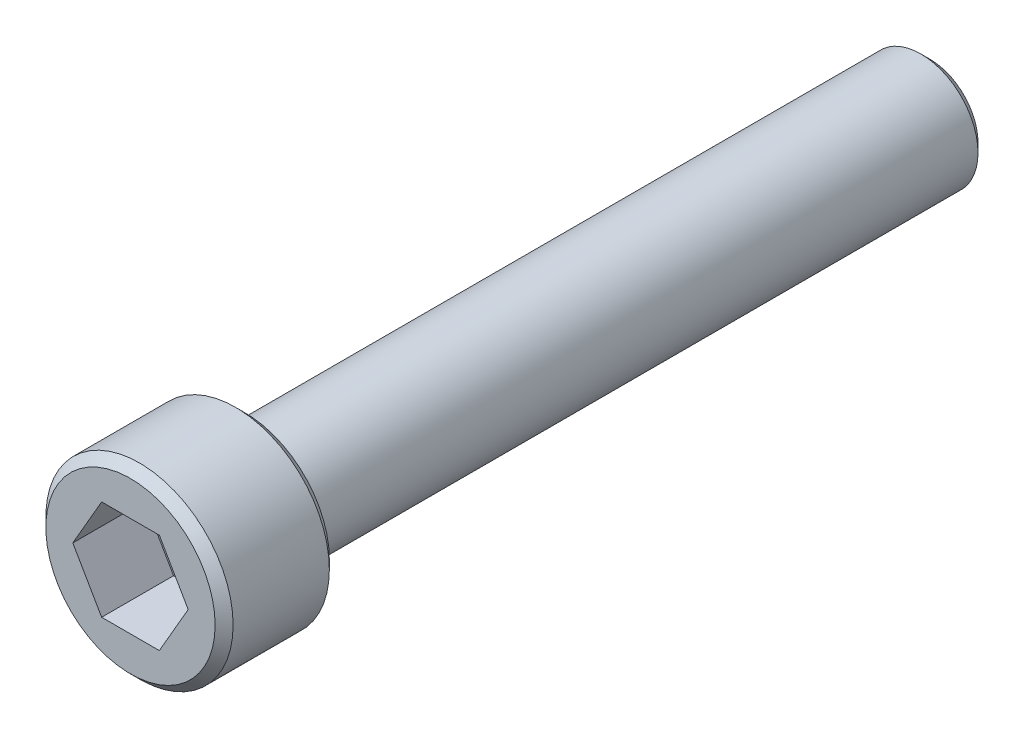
ISO-10303-21;
HEADER;
FILE_DESCRIPTION(('STEP AP214'),'2;1');
FILE_NAME('part.step','',(''),(''),'','','');
FILE_SCHEMA(('AUTOMOTIVE_DESIGN { 1 0 10303 214 1 1 1 1 }'));
ENDSEC;
DATA;
#1=APPLICATION_CONTEXT('core data for automotive mechanical design processes');
#2=APPLICATION_PROTOCOL_DEFINITION('international standard','automotive_design',2000,#1);
#3=PRODUCT_CONTEXT('',#1,'mechanical');
#4=PRODUCT('Part','Part','',(#3));
#5=PRODUCT_RELATED_PRODUCT_CATEGORY('part','',(#4));
#6=PRODUCT_DEFINITION_FORMATION('','',#4);
#7=PRODUCT_DEFINITION_CONTEXT('part definition',#1,'design');
#8=PRODUCT_DEFINITION('design','',#6,#7);
#9=PRODUCT_DEFINITION_SHAPE('','',#8);
#10=(LENGTH_UNIT() NAMED_UNIT(*) SI_UNIT(.MILLI.,.METRE.));
#11=(NAMED_UNIT(*) PLANE_ANGLE_UNIT() SI_UNIT($,.RADIAN.));
#12=(NAMED_UNIT(*) SI_UNIT($,.STERADIAN.) SOLID_ANGLE_UNIT());
#13=UNCERTAINTY_MEASURE_WITH_UNIT(LENGTH_MEASURE(1.E-05),#10,'distance_accuracy_value','');
#14=(GEOMETRIC_REPRESENTATION_CONTEXT(3) GLOBAL_UNCERTAINTY_ASSIGNED_CONTEXT((#13)) GLOBAL_UNIT_ASSIGNED_CONTEXT((#10,
#11,#12)) REPRESENTATION_CONTEXT('',''));
#15=CARTESIAN_POINT('',(0.,0.,0.));
#16=DIRECTION('',(0.,0.,1.));
#17=DIRECTION('',(1.,0.,0.));
#18=AXIS2_PLACEMENT_3D('',#15,#16,#17);
#19=CARTESIAN_POINT('',(0.,0.,19.05));
#20=DIRECTION('',(0.,0.,-1.));
#21=DIRECTION('',(-1.,0.,0.));
#22=AXIS2_PLACEMENT_3D('',#19,#20,#21);
#23=CYLINDRICAL_SURFACE('',#22,1.5875);
#24=CARTESIAN_POINT('',(0.,0.,0.250000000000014));
#25=DIRECTION('',(0.,0.,1.));
#26=DIRECTION('',(1.,0.,0.));
#27=AXIS2_PLACEMENT_3D('',#24,#25,#26);
#28=CIRCLE('',#27,1.5875);
#29=CARTESIAN_POINT('',(-1.5875,0.,0.250000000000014));
#30=VERTEX_POINT('',#29);
#31=EDGE_CURVE('E176',#30,#30,#28,.T.);
#32=CARTESIAN_POINT('',(0.,0.,19.05));
#33=DIRECTION('',(0.,0.,1.));
#34=DIRECTION('',(1.,0.,0.));
#35=AXIS2_PLACEMENT_3D('',#32,#33,#34);
#36=CIRCLE('',#35,1.5875);
#37=CARTESIAN_POINT('',(-1.5875,0.,19.05));
#38=VERTEX_POINT('',#37);
#39=EDGE_CURVE('E162',#38,#38,#36,.T.);
#40=CARTESIAN_POINT('',(-1.5875,0.,0.250000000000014));
#41=CARTESIAN_POINT('',(-1.5875,0.,0.445833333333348));
#42=CARTESIAN_POINT('',(-1.5875,0.,0.641666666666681));
#43=CARTESIAN_POINT('',(-1.5875,0.,1.03333333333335));
#44=CARTESIAN_POINT('',(-1.5875,0.,1.22916666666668));
#45=CARTESIAN_POINT('',(-1.5875,0.,1.62083333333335));
#46=CARTESIAN_POINT('',(-1.5875,0.,1.81666666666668));
#47=CARTESIAN_POINT('',(-1.5875,0.,2.20833333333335));
#48=CARTESIAN_POINT('',(-1.5875,0.,2.40416666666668));
#49=CARTESIAN_POINT('',(-1.5875,0.,2.79583333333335));
#50=CARTESIAN_POINT('',(-1.5875,0.,2.99166666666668));
#51=CARTESIAN_POINT('',(-1.5875,0.,3.38333333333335));
#52=CARTESIAN_POINT('',(-1.5875,0.,3.57916666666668));
#53=CARTESIAN_POINT('',(-1.5875,0.,3.97083333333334));
#54=CARTESIAN_POINT('',(-1.5875,0.,4.16666666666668));
#55=CARTESIAN_POINT('',(-1.5875,0.,4.55833333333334));
#56=CARTESIAN_POINT('',(-1.5875,0.,4.75416666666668));
#57=CARTESIAN_POINT('',(-1.5875,0.,5.14583333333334));
#58=CARTESIAN_POINT('',(-1.5875,0.,5.34166666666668));
#59=CARTESIAN_POINT('',(-1.5875,0.,5.73333333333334));
#60=CARTESIAN_POINT('',(-1.5875,0.,5.92916666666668));
#61=CARTESIAN_POINT('',(-1.5875,0.,6.32083333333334));
#62=CARTESIAN_POINT('',(-1.5875,0.,6.51666666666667));
#63=CARTESIAN_POINT('',(-1.5875,0.,6.90833333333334));
#64=CARTESIAN_POINT('',(-1.5875,0.,7.10416666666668));
#65=CARTESIAN_POINT('',(-1.5875,0.,7.49583333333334));
#66=CARTESIAN_POINT('',(-1.5875,0.,7.69166666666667));
#67=CARTESIAN_POINT('',(-1.5875,0.,8.08333333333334));
#68=CARTESIAN_POINT('',(-1.5875,0.,8.27916666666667));
#69=CARTESIAN_POINT('',(-1.5875,0.,8.67083333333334));
#70=CARTESIAN_POINT('',(-1.5875,0.,8.86666666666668));
#71=CARTESIAN_POINT('',(-1.5875,0.,9.25833333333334));
#72=CARTESIAN_POINT('',(-1.5875,0.,9.45416666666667));
#73=CARTESIAN_POINT('',(-1.5875,0.,9.84583333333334));
#74=CARTESIAN_POINT('',(-1.5875,0.,10.0416666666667));
#75=CARTESIAN_POINT('',(-1.5875,0.,10.4333333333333));
#76=CARTESIAN_POINT('',(-1.5875,0.,10.6291666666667));
#77=CARTESIAN_POINT('',(-1.5875,0.,11.0208333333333));
#78=CARTESIAN_POINT('',(-1.5875,0.,11.2166666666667));
#79=CARTESIAN_POINT('',(-1.5875,0.,11.6083333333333));
#80=CARTESIAN_POINT('',(-1.5875,0.,11.8041666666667));
#81=CARTESIAN_POINT('',(-1.5875,0.,12.1958333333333));
#82=CARTESIAN_POINT('',(-1.5875,0.,12.3916666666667));
#83=CARTESIAN_POINT('',(-1.5875,0.,12.7833333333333));
#84=CARTESIAN_POINT('',(-1.5875,0.,12.9791666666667));
#85=CARTESIAN_POINT('',(-1.5875,0.,13.3708333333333));
#86=CARTESIAN_POINT('',(-1.5875,0.,13.5666666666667));
#87=CARTESIAN_POINT('',(-1.5875,0.,13.9583333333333));
#88=CARTESIAN_POINT('',(-1.5875,0.,14.1541666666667));
#89=CARTESIAN_POINT('',(-1.5875,0.,14.5458333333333));
#90=CARTESIAN_POINT('',(-1.5875,0.,14.7416666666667));
#91=CARTESIAN_POINT('',(-1.5875,0.,15.1333333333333));
#92=CARTESIAN_POINT('',(-1.5875,0.,15.3291666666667));
#93=CARTESIAN_POINT('',(-1.5875,0.,15.7208333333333));
#94=CARTESIAN_POINT('',(-1.5875,0.,15.9166666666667));
#95=CARTESIAN_POINT('',(-1.5875,0.,16.3083333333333));
#96=CARTESIAN_POINT('',(-1.5875,0.,16.5041666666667));
#97=CARTESIAN_POINT('',(-1.5875,0.,16.8958333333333));
#98=CARTESIAN_POINT('',(-1.5875,0.,17.0916666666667));
#99=CARTESIAN_POINT('',(-1.5875,0.,17.4833333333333));
#100=CARTESIAN_POINT('',(-1.5875,0.,17.6791666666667));
#101=CARTESIAN_POINT('',(-1.5875,0.,18.0708333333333));
#102=CARTESIAN_POINT('',(-1.5875,0.,18.2666666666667));
#103=CARTESIAN_POINT('',(-1.5875,0.,18.6583333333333));
#104=CARTESIAN_POINT('',(-1.5875,0.,18.8541666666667));
#105=CARTESIAN_POINT('',(-1.5875,0.,19.05));
#106=B_SPLINE_CURVE_WITH_KNOTS('',3,(#40,#41,#42,#43,#44,#45,#46,#47,#48,#49,#50,#51,#52,#53,
#54,#55,#56,#57,#58,#59,#60,#61,#62,#63,#64,#65,#66,#67,#68,#69,#70,#71,#72,#73,#74,#75,#76,#77,
#78,#79,#80,#81,#82,#83,#84,#85,#86,#87,#88,#89,#90,#91,#92,#93,#94,#95,#96,#97,#98,#99,#100,
#101,#102,#103,#104,#105),.UNSPECIFIED.,.F.,.F.,(4,2,2,2,2,2,2,2,2,2,2,2,2,2,2,2,2,2,2,2,2,2,2,
2,2,2,2,2,2,2,2,2,4),(0.,0.587500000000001,1.175,1.7625,2.35,2.9375,3.525,4.1125,4.7,5.2875,
5.87499999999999,6.46249999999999,7.05,7.63749999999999,8.22499999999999,8.81249999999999,
9.39999999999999,9.98749999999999,10.575,11.1625,11.75,12.3375,12.925,13.5125,14.1,14.6875,
15.275,15.8625,16.45,17.0375,17.625,18.2125,18.8),.UNSPECIFIED.);
#107=EDGE_CURVE('BSEAM50',#30,#38,#106,.T.);
#108=ORIENTED_EDGE('',*,*,#31,.T.);
#109=ORIENTED_EDGE('',*,*,#39,.F.);
#110=ORIENTED_EDGE('',*,*,#107,.T.);
#111=ORIENTED_EDGE('',*,*,#107,.F.);
#112=EDGE_LOOP('',(#108,#110,#109,#111));
#113=FACE_BOUND('',#112,.T.);
#114=ADVANCED_FACE('F50',(#113),#23,.T.);
#115=CARTESIAN_POINT('',(0.,0.,0.));
#116=DIRECTION('',(0.,0.,1.));
#117=DIRECTION('',(1.,0.,0.));
#118=AXIS2_PLACEMENT_3D('',#115,#116,#117);
#119=PLANE('',#118);
#120=CARTESIAN_POINT('',(0.,0.,0.));
#121=DIRECTION('',(0.,0.,1.));
#122=DIRECTION('',(1.,0.,0.));
#123=AXIS2_PLACEMENT_3D('',#120,#121,#122);
#124=CIRCLE('',#123,1.33749999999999);
#125=CARTESIAN_POINT('',(1.33749999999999,0.,0.));
#126=VERTEX_POINT('',#125);
#127=EDGE_CURVE('E179',#126,#126,#124,.F.);
#128=ORIENTED_EDGE('',*,*,#127,.T.);
#129=EDGE_LOOP('',(#128));
#130=FACE_BOUND('',#129,.T.);
#131=ADVANCED_FACE('F208',(#130),#119,.F.);
#132=CARTESIAN_POINT('',(0.,0.,22.225));
#133=DIRECTION('',(0.,0.,-1.));
#134=DIRECTION('',(-1.,0.,0.));
#135=AXIS2_PLACEMENT_3D('',#132,#133,#134);
#136=CYLINDRICAL_SURFACE('',#135,2.6035);
#137=CARTESIAN_POINT('',(0.,0.,19.3));
#138=DIRECTION('',(0.,0.,1.));
#139=DIRECTION('',(1.,0.,0.));
#140=AXIS2_PLACEMENT_3D('',#137,#138,#139);
#141=CIRCLE('',#140,2.6035);
#142=CARTESIAN_POINT('',(2.6035,0.,19.3));
#143=VERTEX_POINT('',#142);
#144=EDGE_CURVE('E190',#143,#143,#141,.T.);
#145=ORIENTED_EDGE('',*,*,#144,.T.);
#146=EDGE_LOOP('',(#145));
#147=FACE_BOUND('',#146,.T.);
#148=CARTESIAN_POINT('',(0.,0.,21.975));
#149=DIRECTION('',(0.,0.,1.));
#150=DIRECTION('',(1.,0.,0.));
#151=AXIS2_PLACEMENT_3D('',#148,#149,#150);
#152=CIRCLE('',#151,2.6035);
#153=CARTESIAN_POINT('',(2.6035,0.,21.975));
#154=VERTEX_POINT('',#153);
#155=EDGE_CURVE('E184',#154,#154,#152,.F.);
#156=ORIENTED_EDGE('',*,*,#155,.T.);
#157=EDGE_LOOP('',(#156));
#158=FACE_BOUND('',#157,.T.);
#159=ADVANCED_FACE('F204',(#147,#158),#136,.T.);
#160=CARTESIAN_POINT('',(0.,0.,22.225));
#161=DIRECTION('',(0.,0.,1.));
#162=DIRECTION('',(1.,0.,0.));
#163=AXIS2_PLACEMENT_3D('',#160,#161,#162);
#164=PLANE('',#163);
#165=CARTESIAN_POINT('',(0.,0.,22.225));
#166=DIRECTION('',(0.,0.,1.));
#167=DIRECTION('',(1.,0.,0.));
#168=AXIS2_PLACEMENT_3D('',#165,#166,#167);
#169=CIRCLE('',#168,2.3535);
#170=CARTESIAN_POINT('',(2.3535,0.,22.225));
#171=VERTEX_POINT('',#170);
#172=EDGE_CURVE('E11',#171,#171,#169,.T.);
#173=ORIENTED_EDGE('',*,*,#172,.T.);
#174=EDGE_LOOP('',(#173));
#175=FACE_BOUND('',#174,.T.);
#176=DIRECTION('',(0.5,0.866025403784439,0.));
#177=VECTOR('',#176,1.);
#178=CARTESIAN_POINT('',(0.801975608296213,-1.3890625,22.225));
#179=LINE('',#178,#177);
#180=CARTESIAN_POINT('',(0.801975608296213,-1.3890625,22.225));
#181=VERTEX_POINT('',#180);
#182=CARTESIAN_POINT('',(1.60395121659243,0.,22.225));
#183=VERTEX_POINT('',#182);
#184=EDGE_CURVE('E63',#181,#183,#179,.T.);
#185=ORIENTED_EDGE('',*,*,#184,.F.);
#186=DIRECTION('',(1.,0.,0.));
#187=VECTOR('',#186,1.);
#188=CARTESIAN_POINT('',(-0.801975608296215,-1.3890625,22.225));
#189=LINE('',#188,#187);
#190=CARTESIAN_POINT('',(-0.801975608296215,-1.3890625,22.225));
#191=VERTEX_POINT('',#190);
#192=EDGE_CURVE('E160',#191,#181,#189,.T.);
#193=ORIENTED_EDGE('',*,*,#192,.F.);
#194=DIRECTION('',(0.5,-0.866025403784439,0.));
#195=VECTOR('',#194,1.);
#196=CARTESIAN_POINT('',(-1.60395121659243,0.,22.225));
#197=LINE('',#196,#195);
#198=CARTESIAN_POINT('',(-1.60395121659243,0.,22.225));
#199=VERTEX_POINT('',#198);
#200=EDGE_CURVE('E152',#199,#191,#197,.T.);
#201=ORIENTED_EDGE('',*,*,#200,.F.);
#202=DIRECTION('',(-0.5,-0.866025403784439,0.));
#203=VECTOR('',#202,1.);
#204=CARTESIAN_POINT('',(-0.801975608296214,1.3890625,22.225));
#205=LINE('',#204,#203);
#206=CARTESIAN_POINT('',(-0.801975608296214,1.3890625,22.225));
#207=VERTEX_POINT('',#206);
#208=EDGE_CURVE('E115',#207,#199,#205,.T.);
#209=ORIENTED_EDGE('',*,*,#208,.F.);
#210=DIRECTION('',(-1.,0.,0.));
#211=VECTOR('',#210,1.);
#212=CARTESIAN_POINT('',(0.801975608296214,1.3890625,22.225));
#213=LINE('',#212,#211);
#214=CARTESIAN_POINT('',(0.801975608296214,1.3890625,22.225));
#215=VERTEX_POINT('',#214);
#216=EDGE_CURVE('E146',#215,#207,#213,.T.);
#217=ORIENTED_EDGE('',*,*,#216,.F.);
#218=DIRECTION('',(-0.5,0.866025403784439,0.));
#219=VECTOR('',#218,1.);
#220=CARTESIAN_POINT('',(1.60395121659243,0.,22.225));
#221=LINE('',#220,#219);
#222=EDGE_CURVE('E145',#183,#215,#221,.T.);
#223=ORIENTED_EDGE('',*,*,#222,.F.);
#224=EDGE_LOOP('',(#185,#193,#201,#209,#217,#223));
#225=FACE_BOUND('',#224,.T.);
#226=ADVANCED_FACE('F210',(#175,#225),#164,.T.);
#227=CARTESIAN_POINT('',(0.,0.,19.05));
#228=DIRECTION('',(0.,0.,1.));
#229=DIRECTION('',(1.,0.,0.));
#230=AXIS2_PLACEMENT_3D('',#227,#228,#229);
#231=PLANE('',#230);
#232=CARTESIAN_POINT('',(0.,0.,19.05));
#233=DIRECTION('',(0.,0.,1.));
#234=DIRECTION('',(1.,0.,0.));
#235=AXIS2_PLACEMENT_3D('',#232,#233,#234);
#236=CIRCLE('',#235,2.3535);
#237=CARTESIAN_POINT('',(2.3535,0.,19.05));
#238=VERTEX_POINT('',#237);
#239=EDGE_CURVE('E60',#238,#238,#236,.F.);
#240=ORIENTED_EDGE('',*,*,#239,.T.);
#241=EDGE_LOOP('',(#240));
#242=FACE_BOUND('',#241,.T.);
#243=ORIENTED_EDGE('',*,*,#39,.T.);
#244=EDGE_LOOP('',(#243));
#245=FACE_BOUND('',#244,.T.);
#246=ADVANCED_FACE('F194',(#242,#245),#231,.F.);
#247=CARTESIAN_POINT('',(0.801975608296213,-1.3890625,20.225));
#248=DIRECTION('',(0.866025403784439,-0.5,0.));
#249=DIRECTION('',(0.5,0.866025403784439,0.));
#250=AXIS2_PLACEMENT_3D('',#247,#248,#249);
#251=PLANE('',#250);
#252=ORIENTED_EDGE('',*,*,#184,.T.);
#253=DIRECTION('',(0.,0.,1.));
#254=VECTOR('',#253,1.);
#255=CARTESIAN_POINT('',(1.60395121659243,0.,20.225));
#256=LINE('',#255,#254);
#257=CARTESIAN_POINT('',(1.60395121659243,0.,20.225));
#258=VERTEX_POINT('',#257);
#259=EDGE_CURVE('E94',#258,#183,#256,.T.);
#260=ORIENTED_EDGE('',*,*,#259,.F.);
#261=DIRECTION('',(0.5,0.866025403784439,0.));
#262=VECTOR('',#261,1.);
#263=CARTESIAN_POINT('',(0.801975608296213,-1.3890625,20.225));
#264=LINE('',#263,#262);
#265=CARTESIAN_POINT('',(0.801975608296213,-1.3890625,20.225));
#266=VERTEX_POINT('',#265);
#267=EDGE_CURVE('E159',#266,#258,#264,.T.);
#268=ORIENTED_EDGE('',*,*,#267,.F.);
#269=DIRECTION('',(0.,0.,1.));
#270=VECTOR('',#269,1.);
#271=CARTESIAN_POINT('',(0.801975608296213,-1.3890625,20.225));
#272=LINE('',#271,#270);
#273=EDGE_CURVE('E75',#266,#181,#272,.T.);
#274=ORIENTED_EDGE('',*,*,#273,.T.);
#275=EDGE_LOOP('',(#252,#260,#268,#274));
#276=FACE_BOUND('',#275,.T.);
#277=ADVANCED_FACE('F226',(#276),#251,.F.);
#278=CARTESIAN_POINT('',(-0.801975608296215,-1.3890625,20.225));
#279=DIRECTION('',(0.,-1.,0.));
#280=DIRECTION('',(1.,0.,0.));
#281=AXIS2_PLACEMENT_3D('',#278,#279,#280);
#282=PLANE('',#281);
#283=ORIENTED_EDGE('',*,*,#192,.T.);
#284=ORIENTED_EDGE('',*,*,#273,.F.);
#285=DIRECTION('',(1.,0.,0.));
#286=VECTOR('',#285,1.);
#287=CARTESIAN_POINT('',(-0.801975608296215,-1.3890625,20.225));
#288=LINE('',#287,#286);
#289=CARTESIAN_POINT('',(-0.801975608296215,-1.3890625,20.225));
#290=VERTEX_POINT('',#289);
#291=EDGE_CURVE('E127',#290,#266,#288,.T.);
#292=ORIENTED_EDGE('',*,*,#291,.F.);
#293=DIRECTION('',(0.,0.,1.));
#294=VECTOR('',#293,1.);
#295=CARTESIAN_POINT('',(-0.801975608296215,-1.3890625,20.225));
#296=LINE('',#295,#294);
#297=EDGE_CURVE('E116',#290,#191,#296,.T.);
#298=ORIENTED_EDGE('',*,*,#297,.T.);
#299=EDGE_LOOP('',(#283,#284,#292,#298));
#300=FACE_BOUND('',#299,.T.);
#301=ADVANCED_FACE('F228',(#300),#282,.F.);
#302=CARTESIAN_POINT('',(-1.60395121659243,0.,20.225));
#303=DIRECTION('',(-0.866025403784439,-0.5,0.));
#304=DIRECTION('',(0.5,-0.866025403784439,0.));
#305=AXIS2_PLACEMENT_3D('',#302,#303,#304);
#306=PLANE('',#305);
#307=ORIENTED_EDGE('',*,*,#200,.T.);
#308=ORIENTED_EDGE('',*,*,#297,.F.);
#309=DIRECTION('',(0.5,-0.866025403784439,0.));
#310=VECTOR('',#309,1.);
#311=CARTESIAN_POINT('',(-1.60395121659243,0.,20.225));
#312=LINE('',#311,#310);
#313=CARTESIAN_POINT('',(-1.60395121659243,0.,20.225));
#314=VERTEX_POINT('',#313);
#315=EDGE_CURVE('E121',#314,#290,#312,.T.);
#316=ORIENTED_EDGE('',*,*,#315,.F.);
#317=DIRECTION('',(0.,0.,1.));
#318=VECTOR('',#317,1.);
#319=CARTESIAN_POINT('',(-1.60395121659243,0.,20.225));
#320=LINE('',#319,#318);
#321=EDGE_CURVE('E104',#314,#199,#320,.T.);
#322=ORIENTED_EDGE('',*,*,#321,.T.);
#323=EDGE_LOOP('',(#307,#308,#316,#322));
#324=FACE_BOUND('',#323,.T.);
#325=ADVANCED_FACE('F125',(#324),#306,.F.);
#326=CARTESIAN_POINT('',(-0.801975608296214,1.3890625,20.225));
#327=DIRECTION('',(-0.866025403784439,0.5,0.));
#328=DIRECTION('',(-0.5,-0.866025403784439,0.));
#329=AXIS2_PLACEMENT_3D('',#326,#327,#328);
#330=PLANE('',#329);
#331=ORIENTED_EDGE('',*,*,#208,.T.);
#332=ORIENTED_EDGE('',*,*,#321,.F.);
#333=DIRECTION('',(-0.5,-0.866025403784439,0.));
#334=VECTOR('',#333,1.);
#335=CARTESIAN_POINT('',(-0.801975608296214,1.3890625,20.225));
#336=LINE('',#335,#334);
#337=CARTESIAN_POINT('',(-0.801975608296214,1.3890625,20.225));
#338=VERTEX_POINT('',#337);
#339=EDGE_CURVE('E108',#338,#314,#336,.T.);
#340=ORIENTED_EDGE('',*,*,#339,.F.);
#341=DIRECTION('',(0.,0.,1.));
#342=VECTOR('',#341,1.);
#343=CARTESIAN_POINT('',(-0.801975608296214,1.3890625,20.225));
#344=LINE('',#343,#342);
#345=EDGE_CURVE('E120',#338,#207,#344,.T.);
#346=ORIENTED_EDGE('',*,*,#345,.T.);
#347=EDGE_LOOP('',(#331,#332,#340,#346));
#348=FACE_BOUND('',#347,.T.);
#349=ADVANCED_FACE('F110',(#348),#330,.F.);
#350=CARTESIAN_POINT('',(0.801975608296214,1.3890625,20.225));
#351=DIRECTION('',(0.,1.,0.));
#352=DIRECTION('',(-1.,0.,0.));
#353=AXIS2_PLACEMENT_3D('',#350,#351,#352);
#354=PLANE('',#353);
#355=ORIENTED_EDGE('',*,*,#216,.T.);
#356=ORIENTED_EDGE('',*,*,#345,.F.);
#357=DIRECTION('',(-1.,0.,0.));
#358=VECTOR('',#357,1.);
#359=CARTESIAN_POINT('',(0.801975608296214,1.3890625,20.225));
#360=LINE('',#359,#358);
#361=CARTESIAN_POINT('',(0.801975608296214,1.3890625,20.225));
#362=VERTEX_POINT('',#361);
#363=EDGE_CURVE('E131',#362,#338,#360,.T.);
#364=ORIENTED_EDGE('',*,*,#363,.F.);
#365=DIRECTION('',(0.,0.,1.));
#366=VECTOR('',#365,1.);
#367=CARTESIAN_POINT('',(0.801975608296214,1.3890625,20.225));
#368=LINE('',#367,#366);
#369=EDGE_CURVE('E169',#362,#215,#368,.T.);
#370=ORIENTED_EDGE('',*,*,#369,.T.);
#371=EDGE_LOOP('',(#355,#356,#364,#370));
#372=FACE_BOUND('',#371,.T.);
#373=ADVANCED_FACE('F268',(#372),#354,.F.);
#374=CARTESIAN_POINT('',(1.60395121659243,0.,20.225));
#375=DIRECTION('',(0.866025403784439,0.5,0.));
#376=DIRECTION('',(-0.5,0.866025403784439,0.));
#377=AXIS2_PLACEMENT_3D('',#374,#375,#376);
#378=PLANE('',#377);
#379=ORIENTED_EDGE('',*,*,#222,.T.);
#380=ORIENTED_EDGE('',*,*,#369,.F.);
#381=DIRECTION('',(-0.5,0.866025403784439,0.));
#382=VECTOR('',#381,1.);
#383=CARTESIAN_POINT('',(1.60395121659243,0.,20.225));
#384=LINE('',#383,#382);
#385=EDGE_CURVE('E136',#258,#362,#384,.T.);
#386=ORIENTED_EDGE('',*,*,#385,.F.);
#387=ORIENTED_EDGE('',*,*,#259,.T.);
#388=EDGE_LOOP('',(#379,#380,#386,#387));
#389=FACE_BOUND('',#388,.T.);
#390=ADVANCED_FACE('F224',(#389),#378,.F.);
#391=CARTESIAN_POINT('',(0.,0.,20.225));
#392=DIRECTION('',(0.,0.,1.));
#393=DIRECTION('',(1.,0.,0.));
#394=AXIS2_PLACEMENT_3D('',#391,#392,#393);
#395=PLANE('',#394);
#396=ORIENTED_EDGE('',*,*,#267,.T.);
#397=ORIENTED_EDGE('',*,*,#385,.T.);
#398=ORIENTED_EDGE('',*,*,#363,.T.);
#399=ORIENTED_EDGE('',*,*,#339,.T.);
#400=ORIENTED_EDGE('',*,*,#315,.T.);
#401=ORIENTED_EDGE('',*,*,#291,.T.);
#402=EDGE_LOOP('',(#396,#397,#398,#399,#400,#401));
#403=FACE_BOUND('',#402,.T.);
#404=ADVANCED_FACE('F129',(#403),#395,.T.);
#405=CARTESIAN_POINT('',(0.,0.,0.250000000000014));
#406=DIRECTION('',(0.,0.,1.));
#407=DIRECTION('',(1.,0.,0.));
#408=AXIS2_PLACEMENT_3D('',#405,#406,#407);
#409=CONICAL_SURFACE('',#408,1.5875,0.785398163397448);
#410=ORIENTED_EDGE('',*,*,#127,.F.);
#411=EDGE_LOOP('',(#410));
#412=FACE_BOUND('',#411,.T.);
#413=ORIENTED_EDGE('',*,*,#31,.F.);
#414=EDGE_LOOP('',(#413));
#415=FACE_BOUND('',#414,.T.);
#416=ADVANCED_FACE('F203',(#412,#415),#409,.T.);
#417=CARTESIAN_POINT('',(0.,0.,19.3));
#418=DIRECTION('',(0.,0.,1.));
#419=DIRECTION('',(1.,0.,0.));
#420=AXIS2_PLACEMENT_3D('',#417,#418,#419);
#421=CONICAL_SURFACE('',#420,2.6035,0.785398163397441);
#422=ORIENTED_EDGE('',*,*,#239,.F.);
#423=EDGE_LOOP('',(#422));
#424=FACE_BOUND('',#423,.T.);
#425=ORIENTED_EDGE('',*,*,#144,.F.);
#426=EDGE_LOOP('',(#425));
#427=FACE_BOUND('',#426,.T.);
#428=ADVANCED_FACE('F196',(#424,#427),#421,.T.);
#429=CARTESIAN_POINT('',(0.,0.,22.225));
#430=DIRECTION('',(0.,0.,-1.));
#431=DIRECTION('',(-1.,0.,0.));
#432=AXIS2_PLACEMENT_3D('',#429,#430,#431);
#433=CONICAL_SURFACE('',#432,2.3535,0.785398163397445);
#434=ORIENTED_EDGE('',*,*,#155,.F.);
#435=EDGE_LOOP('',(#434));
#436=FACE_BOUND('',#435,.T.);
#437=ORIENTED_EDGE('',*,*,#172,.F.);
#438=EDGE_LOOP('',(#437));
#439=FACE_BOUND('',#438,.T.);
#440=ADVANCED_FACE('F49',(#436,#439),#433,.T.);
#441=CLOSED_SHELL('',(#114,#131,#159,#226,#246,#277,#301,#325,#349,#373,#390,#404,#416,#428,#440));
#442=MANIFOLD_SOLID_BREP('B2',#441);
#443=ADVANCED_BREP_SHAPE_REPRESENTATION('',(#18,#442),#14);
#444=SHAPE_DEFINITION_REPRESENTATION(#9,#443);
ENDSEC;
END-ISO-10303-21;
